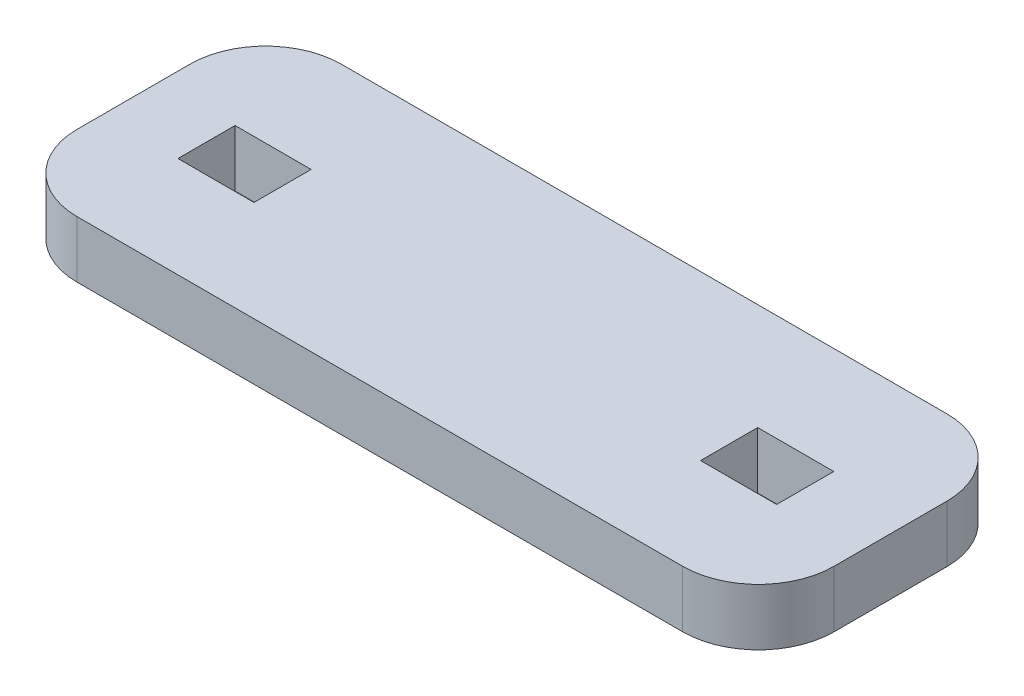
from build123d import *

# Parameters (mm, degrees)
SKETCH1_W           = 20.1
SKETCH1_H           = 15.1
BOSS_EXTRUDE1_DEPTH = 7.5


with BuildPart() as part:
    # Sketch1 → Boss-Extrude1 (new, symmetric)
    with BuildSketch(Plane(origin=(0, 0, 0), x_dir=(1, 0, 0), z_dir=(0, 1, 0))):
        with BuildLine():
            Line((72.831111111, 52.737777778), (232.831111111, 52.737777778))
            ThreePointArc((232.831111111, 52.737777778), (246.973246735, 46.879913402), (252.831111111, 32.737777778))
            Line((252.831111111, 32.737777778), (252.831111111, 2.937777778))
            ThreePointArc((252.831111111, 2.937777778), (246.973246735, -11.204357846), (232.831111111, -17.062222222))
            Line((232.831111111, -17.062222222), (72.831111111, -17.062222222))
            ThreePointArc((72.831111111, -17.062222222), (58.688975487, -11.204357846), (52.831111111, 2.937777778))
            Line((52.831111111, 2.937777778), (52.831111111, 32.737777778))
            ThreePointArc((52.831111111, 32.737777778), (58.688975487, 46.879913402), (72.831111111, 52.737777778))
        make_face()
        with Locations((221.046868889, 17.045968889)):
            Rectangle(SKETCH1_W, SKETCH1_H, mode=Mode.SUBTRACT)
        with Locations((82.881111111, 17.114177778)):
            Rectangle(SKETCH1_W, SKETCH1_H, mode=Mode.SUBTRACT)
    extrude(amount=BOSS_EXTRUDE1_DEPTH, both=True)


solid = part.part
